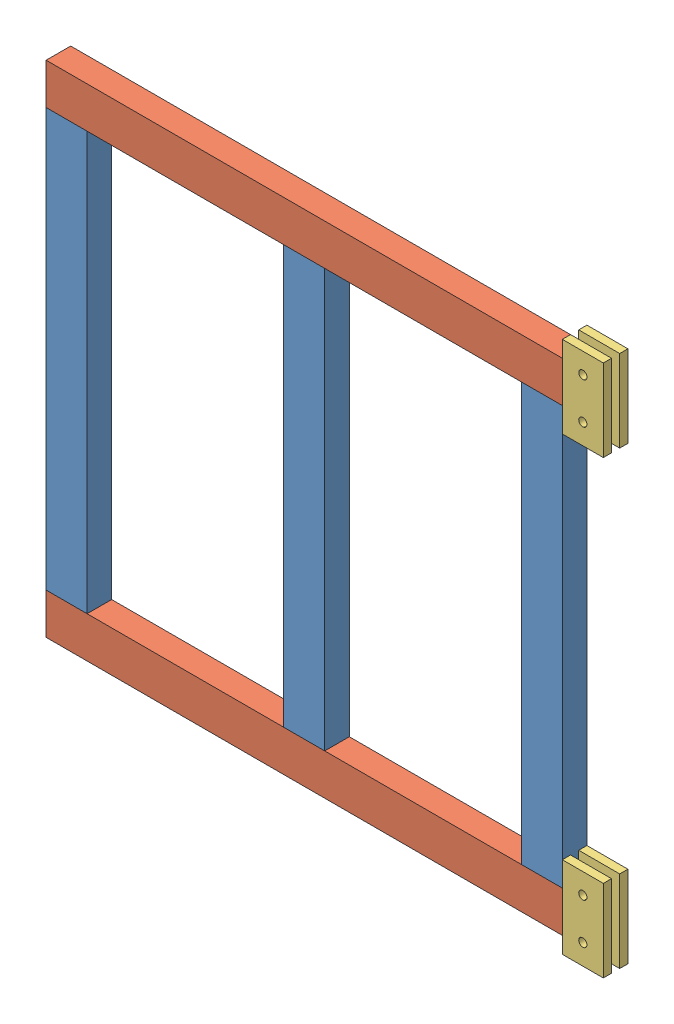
SolidWorks assembly blade.SLDASM, configuration Default (file format 11000). Lengths in mm.
Overall size (680 650 30).
9 component instances, 3 part files, 24 mates.
Components (placement in the parent):
- blades clumns-1: blades clumns.SLDPRT [Default] at (200.5792 19.4678 478.3677) size (50 510 30)
- blades clumns-2: blades clumns.SLDPRT [Default] at (-89.4208 529.4678 478.3677) x (-1 0 0) z (0 0 1) size (50 510 30)
- blades beam-1: blades beam.SLDPRT [Default] at (-404.4208 554.4678 478.3677) x (0 0 -1) z (0 -1 0) size (30 630 50)
- blades beam-2: blades beam.SLDPRT [Default] at (225.5792 -5.5322 478.3677) x (0 0 1) z (0 -1 0) size (30 630 50)
- blades clumns-3: blades clumns.SLDPRT [Default] at (-379.4208 19.4678 478.3677) size (50 510 30)
- blades patch-1: blades patch.SLDPRT [Default] at (250.5792 549.4678 493.3677) x (0 1 0) z (-1 0 0) size (100 10 50)
- blades patch-2: blades patch.SLDPRT [Default] at (250.5792 -0.5322 493.3677) x (0 1 0) z (-1 0 0) size (100 10 50)
- blades patch-3: blades patch.SLDPRT [Default] at (250.5792 549.4678 473.3677) x (0 1 0) z (-1 0 0) size (100 10 50)
- blades patch-6: blades patch.SLDPRT [Default] at (250.5792 -0.5322 473.3677) x (0 1 0) z (-1 0 0) size (100 10 50)
Mates (geometry in assembly coordinates):
- Coincident1: coincident: plane of assembly; plane of assembly; plane of blades clumns-1 through (200.5792 529.4678 478.3677) normal (0 1 0); plane of blades beam-1 through (225.5792 529.4678 493.3677) normal (0 -1 0)
- Coincident2: coincident: plane of assembly; plane of assembly; plane of blades clumns-1 through (225.5792 529.4678 463.3677) normal (1 0 0); plane of blades beam-1 through (225.5792 554.4678 478.3677) normal (1 0 0)
- Coincident3: coincident: point of assembly; point of assembly; point of blades clumns-1; point of blades beam-1
- Coincident8: coincident: point of assembly; point of assembly; point of blades beam-1; point of blades clumns-3
- Coincident9: coincident: plane of assembly; plane of assembly; plane of blades beam-1 through (225.5792 579.4678 493.3677) normal (0 0 1); plane of blades clumns-3 through (-404.4208 529.4678 493.3677) normal (0 0 1)
- Coincident12: coincident: point of assembly; point of assembly; point of blades beam-2; point of blades clumns-3
- Coincident15: coincident: plane of assembly; plane of assembly; plane of blades beam-2 through (-404.4208 19.4678 493.3677) normal (0 0 1); plane of blades clumns-3 through (-404.4208 529.4678 493.3677) normal (0 0 1)
- Coincident16: coincident: plane of assembly; plane of assembly; plane of blades clumns-2 through (-64.4208 19.4678 493.3677) normal (0 0 1); plane of blades beam-1 through (225.5792 579.4678 493.3677) normal (0 0 1)
- Coincident17: coincident: plane of assembly; plane of assembly; plane of blades clumns-2 through (-89.4208 529.4678 478.3677) normal (0 1 0); plane of blades beam-1 through (225.5792 529.4678 493.3677) normal (0 -1 0)
- Coincident18: coincident: point of assembly; point of assembly; moEndPointRef_w of blades clumns-2; moEndPointRef_w of blades beam-1
- Coincident19: coincident: plane of assembly; plane of assembly; plane of blades clumns-1 through (225.5792 529.4678 463.3677) normal (1 0 0); plane of blades patch-1 through (225.5792 499.4678 483.3677) normal (-1 0 0)
- Parallel1: parallel: plane of assembly; plane of assembly; plane of blades clumns-1 through (175.5792 529.4678 493.3677) normal (0 0 1); plane of blades patch-1 through (250.5792 549.4678 483.3677) normal (0 0 -1)
- Coincident20: coincident: plane of assembly; plane of assembly; plane of blades clumns-1 through (225.5792 529.4678 463.3677) normal (1 0 0); plane of blades patch-2 through (225.5792 -50.5322 483.3677) normal (-1 0 0)
- Coincident21: coincident: plane of assembly; plane of assembly; plane of blades clumns-1 through (175.5792 529.4678 493.3677) normal (0 0 1); plane of blades patch-1 through (250.5792 549.4678 493.3677) normal (0 0 1)
- Coincident22: coincident: plane of assembly; plane of assembly; plane of blades clumns-1 through (175.5792 529.4678 493.3677) normal (0 0 1); plane of blades patch-2 through (250.5792 -0.5322 493.3677) normal (0 0 1)
- Distance1: distance = 450 mm: plane of assembly; plane of assembly; plane of blades patch-1 through (275.5792 499.4678 483.3677) normal (0 -1 0); plane of blades patch-2 through (275.5792 49.4678 483.3677) normal (0 1 0)
- Width1: width: plane of assembly; plane of assembly; plane of assembly; plane of assembly; plane of blades patch-2 through (275.5792 -50.5322 483.3677) normal (0 -1 0); plane of blades patch-1 through (275.5792 599.4678 483.3677) normal (0 1 0); plane of blades beam-1 through (225.5792 579.4678 493.3677) normal (0 1 0); plane of blades beam-2 through (-404.4208 -30.5322 463.3677) normal (0 -1 0)
- Coincident24: coincident: plane of assembly; plane of assembly; plane of blades beam-2 through (-404.4208 -5.5322 478.3677) normal (-1 0 0); plane of blades clumns-3 through (-404.4208 529.4678 463.3677) normal (-1 0 0)
- Coincident25: coincident: plane of assembly; plane of assembly; plane of blades clumns-1 through (175.5792 529.4678 463.3677) normal (0 0 -1); plane of blades patch-3 through (250.5792 549.4678 463.3677) normal (0 0 -1)
- Coincident26: coincident: plane of assembly; plane of assembly; plane of blades clumns-1 through (175.5792 529.4678 463.3677) normal (0 0 -1); plane of blades patch-6 through (250.5792 -0.5322 463.3677) normal (0 0 -1)
- Concentric1: concentric: cylinder of assembly; cylinder of assembly; cylinder of blades patch-1 through (250.5792 574.4678 493.3677) axis (0 0 -1) radius 5; cylinder of blades patch-3 through (250.5792 574.4678 473.3677) axis (0 0 -1) radius 5
- Concentric2: concentric: cylinder of assembly; cylinder of assembly; cylinder of blades patch-1 through (250.5792 524.4678 493.3677) axis (0 0 -1) radius 5; cylinder of blades patch-3 through (250.5792 524.4678 473.3677) axis (0 0 -1) radius 5
- Concentric3: concentric: cylinder of assembly; cylinder of assembly; cylinder of blades patch-2 through (250.5792 24.4678 493.3677) axis (0 0 -1) radius 5; cylinder of blades patch-6 through (250.5792 24.4678 473.3677) axis (0 0 -1) radius 5
- Concentric4: concentric: cylinder of assembly; cylinder of assembly; cylinder of blades patch-2 through (250.5792 -25.5322 493.3677) axis (0 0 -1) radius 5; cylinder of blades patch-6 through (250.5792 -25.5322 473.3677) axis (0 0 -1) radius 5
